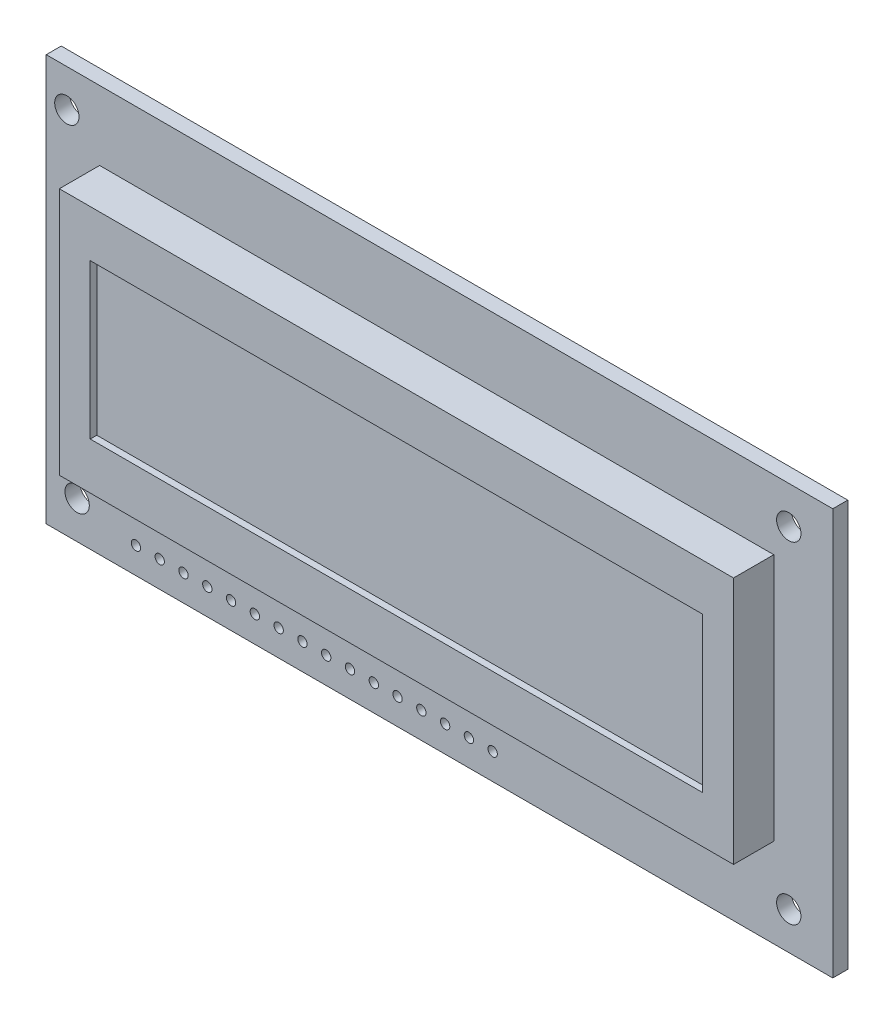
from build123d import *

# Parameters (mm, degrees)
ESQUISSE1_W             = 84
ESQUISSE1_H             = 43.4
ESQUISSE1_R             = 1.3
ESQUISSE1_R_2           = 0.5
EXTRUSION1_DEPTH        = 1.6
ESQUISSE2_W             = 72
ESQUISSE2_H             = 26.5
EXTRUSION2_DEPTH        = 4.3
ESQUISSE3_W             = 65.4
ESQUISSE3_H             = 16.5
ENL_V_MAT_EXTRU_1_DEPTH = 0.7


with BuildPart() as part:
    # Esquisse1 → Extrusion1 (new body)
    with BuildSketch(Plane.XY):
        with Locations((50.2, 21.7)):
            Rectangle(ESQUISSE1_W, ESQUISSE1_H)
        with Locations((11.5, 4)):
            Circle(ESQUISSE1_R, mode=Mode.SUBTRACT)
        with Locations((87.5, 4)):
            Circle(ESQUISSE1_R, mode=Mode.SUBTRACT)
        with Locations((10.4, 39.4)):
            Circle(ESQUISSE1_R, mode=Mode.SUBTRACT)
        with Locations(Location((87.5, 39.4, 0), (0, 0, 180))):
            Circle(ESQUISSE1_R, mode=Mode.SUBTRACT)
        with Locations((17.78, 2.8)):
            Circle(ESQUISSE1_R_2, mode=Mode.SUBTRACT)
        with Locations((20.32, 2.8)):
            Circle(ESQUISSE1_R_2, mode=Mode.SUBTRACT)
        with Locations((22.86, 2.8)):
            Circle(ESQUISSE1_R_2, mode=Mode.SUBTRACT)
        with Locations((25.4, 2.8)):
            Circle(ESQUISSE1_R_2, mode=Mode.SUBTRACT)
        with Locations((27.94, 2.8)):
            Circle(ESQUISSE1_R_2, mode=Mode.SUBTRACT)
        with Locations((30.48, 2.8)):
            Circle(ESQUISSE1_R_2, mode=Mode.SUBTRACT)
        with Locations((33.02, 2.8)):
            Circle(ESQUISSE1_R_2, mode=Mode.SUBTRACT)
        with Locations((35.56, 2.8)):
            Circle(ESQUISSE1_R_2, mode=Mode.SUBTRACT)
        with Locations((38.1, 2.8)):
            Circle(ESQUISSE1_R_2, mode=Mode.SUBTRACT)
        with Locations((40.64, 2.8)):
            Circle(ESQUISSE1_R_2, mode=Mode.SUBTRACT)
        with Locations((43.18, 2.8)):
            Circle(ESQUISSE1_R_2, mode=Mode.SUBTRACT)
        with Locations((45.72, 2.8)):
            Circle(ESQUISSE1_R_2, mode=Mode.SUBTRACT)
        with Locations((48.26, 2.8)):
            Circle(ESQUISSE1_R_2, mode=Mode.SUBTRACT)
        with Locations((50.8, 2.8)):
            Circle(ESQUISSE1_R_2, mode=Mode.SUBTRACT)
        with Locations((53.34, 2.8)):
            Circle(ESQUISSE1_R_2, mode=Mode.SUBTRACT)
        with Locations((55.88, 2.8)):
            Circle(ESQUISSE1_R_2, mode=Mode.SUBTRACT)
    extrude(amount=EXTRUSION1_DEPTH)

    # Esquisse2 → Extrusion2 (add)
    with BuildSketch(Plane.XY.offset(1.6)):
        with Locations((49.9, 22.75)):
            Rectangle(ESQUISSE2_W, ESQUISSE2_H)
    extrude(amount=EXTRUSION2_DEPTH)

    # Esquisse3 → Enl_v. mat.-Extru.1 (cut)
    with BuildSketch(Plane.XY.offset(5.9)):
        with Locations((49.9, 22.75)):
            Rectangle(ESQUISSE3_W, ESQUISSE3_H)
    extrude(amount=-ENL_V_MAT_EXTRU_1_DEPTH, mode=Mode.SUBTRACT)


solid = part.part
